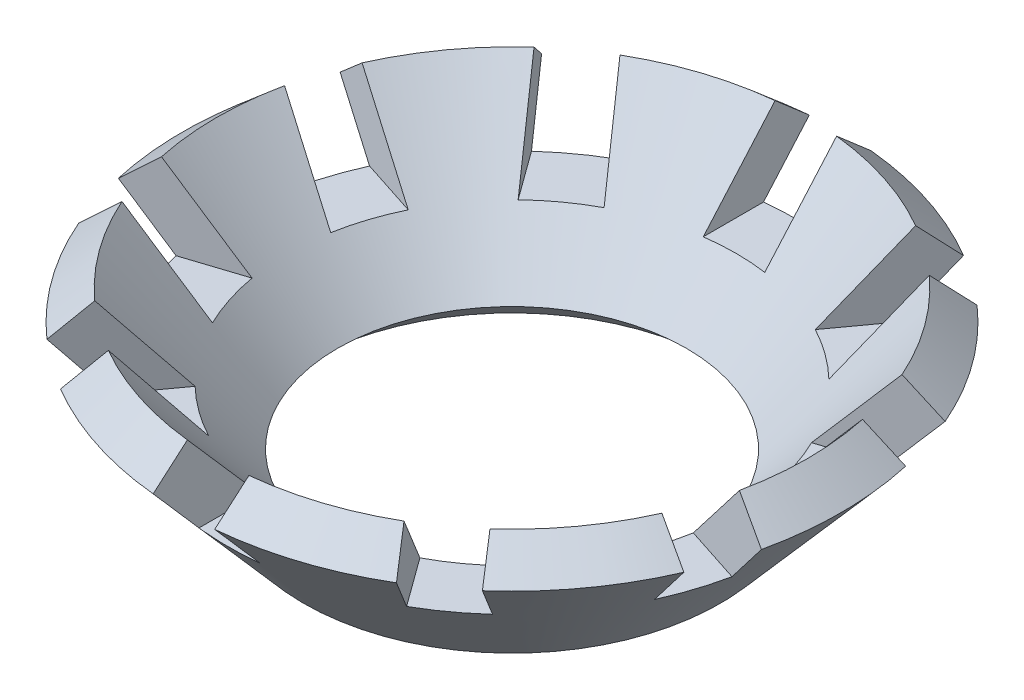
from build123d import *

# Parameters (mm, degrees)
SKETCH_2_W               = 0.762
SKETCH_2_H               = 1.016
CUT_EXTRUDE_1_DEPTH      = 7.138127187
PATTERN_CIRCULAR_1_COUNT = 10


with BuildPart() as part:
    # Sketch 1 → Revolve 1 (revolve)
    with BuildSketch(Plane(origin=(0, 0, 0), x_dir=(0, 0, -1), z_dir=(1, 0, 0))):
        Polygon((2.159, -1.7252661), (2.580731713, -2.091871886), (4.080482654, -0.366605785), (3.65875094, 0), align=None)
    revolve(axis=Axis((0, -11.687365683, 0), (0, 1, 0)))

    # Sketch 2 → Cut-Extrude 1 (cut, through all)
    with BuildSketch(Plane.XY):
        with Locations((0, -0.508)):
            Rectangle(SKETCH_2_W, SKETCH_2_H)
    cut_extrude_1 = extrude(amount=-CUT_EXTRUDE_1_DEPTH, mode=Mode.SUBTRACT)

    # Pattern Circular 1: Cut-Extrude 1 ×10 about axis
    pattern_circular_1_axis = Axis((0, 0, 0), (0, 1, 0))
    for i in range(1, PATTERN_CIRCULAR_1_COUNT):
        add(cut_extrude_1.rotate(pattern_circular_1_axis, i * 360 / PATTERN_CIRCULAR_1_COUNT), mode=Mode.SUBTRACT)


solid = part.part
